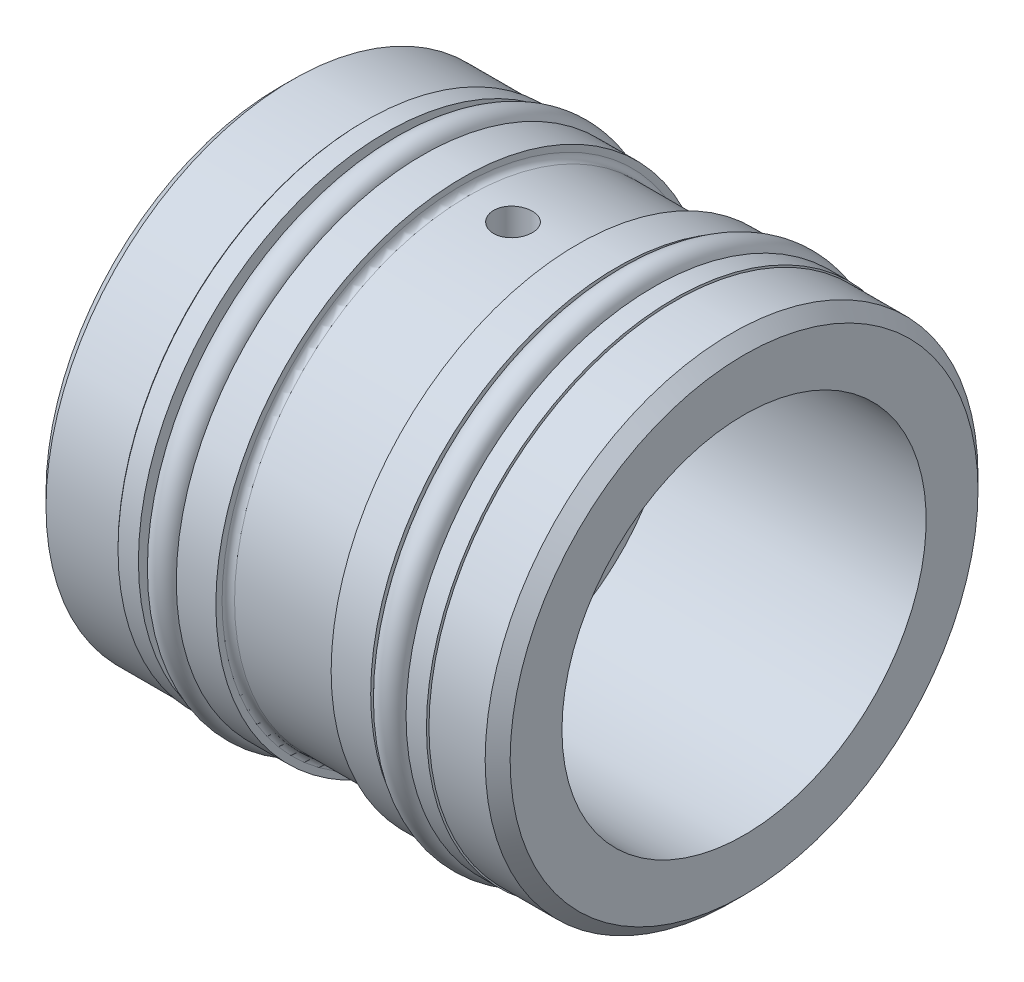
from build123d import *

# Parameters (mm, degrees)
FILLET1_R               = 0.381
CHAMFER1_SIZE           = 0.762
SKETCH6_R               = 0.889
SKETCH6_W               = 1.2446
SKETCH6_H               = 1.3462
CUT_EXTRUDE1_DEPTH      = 27.059066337
CUT_EXTRUDE1_DEPTH_BACK = 27.059066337
SKETCH7_R               = 1.1811


with BuildPart() as part:
    # Sketch1 → Revolve1 (revolve)
    with BuildSketch(Plane.XY, mode=Mode.PRIVATE) as revolve1_sk:
        Polygon((-14.1605, 6.35), (-14.1605, 15.0368), (-9.0043, 15.0368), (-9.0043, 13.7668), (-5.4483, 13.7668), (-5.4483, 15.0368), (-3.0353, 15.0368), (-3.0353, 14.2748), (4.0005, 14.2748), (4.0005, 15.0368), (6.4135, 15.0368), (6.4135, 13.7668), (9.9695, 13.7668), (9.9695, 15.0368), (14.1605, 15.0368), (14.1605, 11.1125), (-1.2319, 11.1125), (-1.2319, 6.35), align=None)
    revolve(revolve1_sk.sketch.rotate(Axis((0, 0, 0), (1, 0, 0)), 90), axis=Axis((0, 0, 0), (1, 0, 0)))

    # Fillet1
    fillet1_edges = [part.edges().sort_by_distance(p)[0] for p in [
        (-3.0353, 0, -14.2748),
        (4.0005, 0, -14.2748),
    ]]
    fillet(fillet1_edges, radius=FILLET1_R)

    # Chamfer1
    chamfer1_edges = [part.edges().sort_by_distance(p)[0] for p in [
        (-14.1605, 0, -15.0368),
        (14.1605, 0, -15.0368),
    ]]
    chamfer(chamfer1_edges, length=CHAMFER1_SIZE)

    # Sketch6 → Revolve3 (revolve)
    with BuildSketch(Plane.XY, mode=Mode.PRIVATE) as revolve3_sk:
        with Locations((-6.4135, 14.5796)):
            Circle(SKETCH6_R)
        with Locations((7.3787, 14.5796)):
            Circle(SKETCH6_R)
        with Locations((-8.3058, 14.4399)):
            Rectangle(SKETCH6_W, SKETCH6_H)
        with Locations((9.271, 14.4399)):
            Rectangle(SKETCH6_W, SKETCH6_H)
    revolve(revolve3_sk.sketch.rotate(Axis((0, 0, 0), (1, 0, 0)), 90), axis=Axis((0, 0, 0), (1, 0, 0)))

    # Sketch7 → Cut-Extrude1 (cut, two sides: drawn at the far end of the back side and taken through both)
    with BuildSketch(Plane(origin=(0, 0, 0), x_dir=(0, 0, -1), z_dir=(0, 1, 0)).offset(-CUT_EXTRUDE1_DEPTH_BACK)):
        with Locations(Location((0, -0.0635, 0), (0, 0, 180))):
            Circle(SKETCH7_R)
    extrude(amount=CUT_EXTRUDE1_DEPTH + CUT_EXTRUDE1_DEPTH_BACK, mode=Mode.SUBTRACT)


solid = part.part
